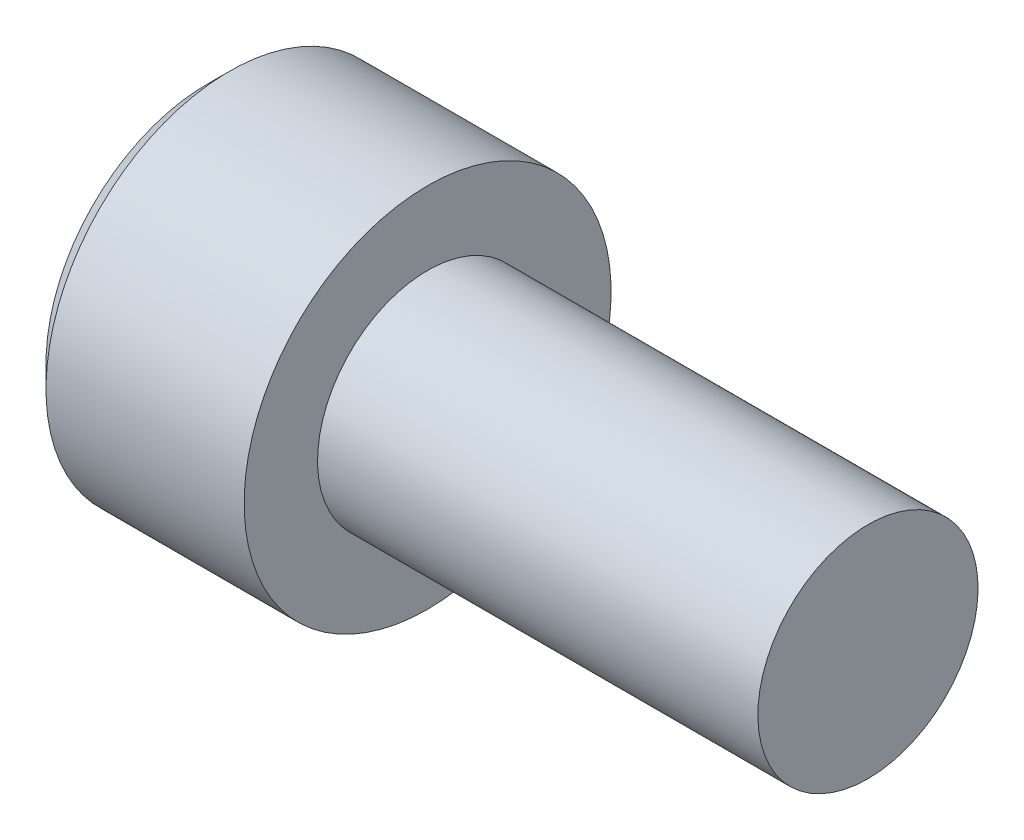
ISO-10303-21;
HEADER;
FILE_DESCRIPTION(('STEP AP214'),'2;1');
FILE_NAME('part.step','',(''),(''),'','','');
FILE_SCHEMA(('AUTOMOTIVE_DESIGN { 1 0 10303 214 1 1 1 1 }'));
ENDSEC;
DATA;
#1=APPLICATION_CONTEXT('core data for automotive mechanical design processes');
#2=APPLICATION_PROTOCOL_DEFINITION('international standard','automotive_design',2000,#1);
#3=PRODUCT_CONTEXT('',#1,'mechanical');
#4=PRODUCT('Part','Part','',(#3));
#5=PRODUCT_RELATED_PRODUCT_CATEGORY('part','',(#4));
#6=PRODUCT_DEFINITION_FORMATION('','',#4);
#7=PRODUCT_DEFINITION_CONTEXT('part definition',#1,'design');
#8=PRODUCT_DEFINITION('design','',#6,#7);
#9=PRODUCT_DEFINITION_SHAPE('','',#8);
#10=(LENGTH_UNIT() NAMED_UNIT(*) SI_UNIT(.MILLI.,.METRE.));
#11=(NAMED_UNIT(*) PLANE_ANGLE_UNIT() SI_UNIT($,.RADIAN.));
#12=(NAMED_UNIT(*) SI_UNIT($,.STERADIAN.) SOLID_ANGLE_UNIT());
#13=UNCERTAINTY_MEASURE_WITH_UNIT(LENGTH_MEASURE(1.E-05),#10,'distance_accuracy_value','');
#14=(GEOMETRIC_REPRESENTATION_CONTEXT(3) GLOBAL_UNCERTAINTY_ASSIGNED_CONTEXT((#13)) GLOBAL_UNIT_ASSIGNED_CONTEXT((#10,
#11,#12)) REPRESENTATION_CONTEXT('',''));
#15=CARTESIAN_POINT('',(0.,0.,0.));
#16=DIRECTION('',(0.,0.,1.));
#17=DIRECTION('',(1.,0.,0.));
#18=AXIS2_PLACEMENT_3D('',#15,#16,#17);
#19=CARTESIAN_POINT('',(-3.,0.,0.));
#20=DIRECTION('',(-1.,0.,0.));
#21=DIRECTION('',(0.,0.,1.));
#22=AXIS2_PLACEMENT_3D('',#19,#20,#21);
#23=PLANE('',#22);
#24=CARTESIAN_POINT('',(-2.9999999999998,0.,0.));
#25=DIRECTION('',(-1.,0.,0.));
#26=DIRECTION('',(0.,0.,1.));
#27=AXIS2_PLACEMENT_3D('',#24,#25,#26);
#28=CIRCLE('',#27,2.49999999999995);
#29=CARTESIAN_POINT('',(-2.9999999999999,2.16506350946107,1.24999999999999));
#30=VERTEX_POINT('',#29);
#31=CARTESIAN_POINT('',(-2.9999999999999,0.,2.49999999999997));
#32=VERTEX_POINT('',#31);
#33=EDGE_CURVE('E18',#30,#32,#28,.F.);
#34=ORIENTED_EDGE('',*,*,#33,.T.);
#35=DIRECTION('',(0.,1.,0.));
#36=VECTOR('',#35,1.);
#37=CARTESIAN_POINT('',(-3.,0.,2.5));
#38=LINE('',#37,#36);
#39=CARTESIAN_POINT('',(-3.,1.44337567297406,2.5));
#40=VERTEX_POINT('',#39);
#41=EDGE_CURVE('E83',#32,#40,#38,.T.);
#42=ORIENTED_EDGE('',*,*,#41,.T.);
#43=DIRECTION('',(0.,0.5,-0.866025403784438));
#44=VECTOR('',#43,1.);
#45=CARTESIAN_POINT('',(-3.,1.44337567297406,2.5));
#46=LINE('',#45,#44);
#47=EDGE_CURVE('E103',#40,#30,#46,.T.);
#48=ORIENTED_EDGE('',*,*,#47,.T.);
#49=EDGE_LOOP('',(#34,#42,#48));
#50=FACE_BOUND('',#49,.T.);
#51=ADVANCED_FACE('F15',(#50),#23,.T.);
#52=CARTESIAN_POINT('',(-3.,0.,0.));
#53=DIRECTION('',(-1.,0.,0.));
#54=DIRECTION('',(0.,0.,1.));
#55=AXIS2_PLACEMENT_3D('',#52,#53,#54);
#56=PLANE('',#55);
#57=CARTESIAN_POINT('',(-2.9999999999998,0.,0.));
#58=DIRECTION('',(-1.,0.,0.));
#59=DIRECTION('',(0.,0.,1.));
#60=AXIS2_PLACEMENT_3D('',#57,#58,#59);
#61=CIRCLE('',#60,2.49999999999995);
#62=CARTESIAN_POINT('',(-2.9999999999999,-2.16506350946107,1.24999999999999));
#63=VERTEX_POINT('',#62);
#64=EDGE_CURVE('E113',#32,#63,#61,.F.);
#65=ORIENTED_EDGE('',*,*,#64,.T.);
#66=DIRECTION('',(0.,0.5,0.866025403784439));
#67=VECTOR('',#66,1.);
#68=CARTESIAN_POINT('',(-3.,-2.1650635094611,1.25));
#69=LINE('',#68,#67);
#70=CARTESIAN_POINT('',(-3.,-1.44337567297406,2.5));
#71=VERTEX_POINT('',#70);
#72=EDGE_CURVE('E121',#63,#71,#69,.T.);
#73=ORIENTED_EDGE('',*,*,#72,.T.);
#74=DIRECTION('',(0.,1.,0.));
#75=VECTOR('',#74,1.);
#76=CARTESIAN_POINT('',(-3.,0.,2.5));
#77=LINE('',#76,#75);
#78=EDGE_CURVE('E129',#71,#32,#77,.T.);
#79=ORIENTED_EDGE('',*,*,#78,.T.);
#80=EDGE_LOOP('',(#65,#73,#79));
#81=FACE_BOUND('',#80,.T.);
#82=ADVANCED_FACE('F365',(#81),#56,.T.);
#83=CARTESIAN_POINT('',(-3.,0.,0.));
#84=DIRECTION('',(-1.,0.,0.));
#85=DIRECTION('',(0.,0.,1.));
#86=AXIS2_PLACEMENT_3D('',#83,#84,#85);
#87=PLANE('',#86);
#88=CARTESIAN_POINT('',(-2.9999999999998,0.,0.));
#89=DIRECTION('',(-1.,0.,0.));
#90=DIRECTION('',(0.,0.,1.));
#91=AXIS2_PLACEMENT_3D('',#88,#89,#90);
#92=CIRCLE('',#91,2.49999999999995);
#93=CARTESIAN_POINT('',(-2.9999999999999,0.,-2.49999999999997));
#94=VERTEX_POINT('',#93);
#95=CARTESIAN_POINT('',(-2.9999999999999,2.16506350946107,-1.24999999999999));
#96=VERTEX_POINT('',#95);
#97=EDGE_CURVE('E99',#94,#96,#92,.F.);
#98=ORIENTED_EDGE('',*,*,#97,.T.);
#99=DIRECTION('',(0.,-0.5,-0.866025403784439));
#100=VECTOR('',#99,1.);
#101=CARTESIAN_POINT('',(-3.,2.1650635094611,-1.25));
#102=LINE('',#101,#100);
#103=CARTESIAN_POINT('',(-3.,1.44337567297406,-2.5));
#104=VERTEX_POINT('',#103);
#105=EDGE_CURVE('E114',#96,#104,#102,.T.);
#106=ORIENTED_EDGE('',*,*,#105,.T.);
#107=DIRECTION('',(0.,1.,0.));
#108=VECTOR('',#107,1.);
#109=CARTESIAN_POINT('',(-3.,0.,-2.5));
#110=LINE('',#109,#108);
#111=EDGE_CURVE('E117',#104,#94,#110,.F.);
#112=ORIENTED_EDGE('',*,*,#111,.T.);
#113=EDGE_LOOP('',(#98,#106,#112));
#114=FACE_BOUND('',#113,.T.);
#115=ADVANCED_FACE('F356',(#114),#87,.T.);
#116=CARTESIAN_POINT('',(-2.99999999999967,0.,0.));
#117=DIRECTION('',(-1.,0.,0.));
#118=DIRECTION('',(0.,0.,1.));
#119=AXIS2_PLACEMENT_3D('',#116,#117,#118);
#120=CONICAL_SURFACE('',#119,2.49999999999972,1.04719755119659);
#121=CARTESIAN_POINT('',(-1.5566243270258,0.,0.));
#122=VERTEX_POINT('',#121);
#123=VERTEX_LOOP('',#122);
#124=FACE_BOUND('',#123,.T.);
#125=ORIENTED_EDGE('',*,*,#33,.F.);
#126=CARTESIAN_POINT('',(-2.9999999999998,0.,0.));
#127=DIRECTION('',(-1.,0.,0.));
#128=DIRECTION('',(0.,0.,1.));
#129=AXIS2_PLACEMENT_3D('',#126,#127,#128);
#130=CIRCLE('',#129,2.49999999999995);
#131=EDGE_CURVE('E89',#96,#30,#130,.F.);
#132=ORIENTED_EDGE('',*,*,#131,.F.);
#133=ORIENTED_EDGE('',*,*,#97,.F.);
#134=CARTESIAN_POINT('',(-2.9999999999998,0.,0.));
#135=DIRECTION('',(-1.,0.,0.));
#136=DIRECTION('',(0.,0.,1.));
#137=AXIS2_PLACEMENT_3D('',#134,#135,#136);
#138=CIRCLE('',#137,2.49999999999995);
#139=CARTESIAN_POINT('',(-2.9999999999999,-2.16506350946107,-1.24999999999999));
#140=VERTEX_POINT('',#139);
#141=EDGE_CURVE('E151',#140,#94,#138,.F.);
#142=ORIENTED_EDGE('',*,*,#141,.F.);
#143=CARTESIAN_POINT('',(-2.9999999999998,0.,0.));
#144=DIRECTION('',(-1.,0.,0.));
#145=DIRECTION('',(0.,0.,1.));
#146=AXIS2_PLACEMENT_3D('',#143,#144,#145);
#147=CIRCLE('',#146,2.49999999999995);
#148=EDGE_CURVE('E115',#63,#140,#147,.F.);
#149=ORIENTED_EDGE('',*,*,#148,.F.);
#150=ORIENTED_EDGE('',*,*,#64,.F.);
#151=EDGE_LOOP('',(#125,#132,#133,#142,#149,#150));
#152=FACE_BOUND('',#151,.T.);
#153=ADVANCED_FACE('F111',(#124,#152),#120,.F.);
#154=CARTESIAN_POINT('',(-3.,0.,0.));
#155=DIRECTION('',(-1.,0.,0.));
#156=DIRECTION('',(0.,0.,1.));
#157=AXIS2_PLACEMENT_3D('',#154,#155,#156);
#158=PLANE('',#157);
#159=ORIENTED_EDGE('',*,*,#141,.T.);
#160=DIRECTION('',(0.,1.,0.));
#161=VECTOR('',#160,1.);
#162=CARTESIAN_POINT('',(-3.,1.44337567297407,-2.5));
#163=LINE('',#162,#161);
#164=CARTESIAN_POINT('',(-3.,-1.44337567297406,-2.5));
#165=VERTEX_POINT('',#164);
#166=EDGE_CURVE('E153',#94,#165,#163,.F.);
#167=ORIENTED_EDGE('',*,*,#166,.T.);
#168=DIRECTION('',(0.,-0.500000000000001,0.866025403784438));
#169=VECTOR('',#168,1.);
#170=CARTESIAN_POINT('',(-3.,-1.44337567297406,-2.5));
#171=LINE('',#170,#169);
#172=EDGE_CURVE('E98',#165,#140,#171,.T.);
#173=ORIENTED_EDGE('',*,*,#172,.T.);
#174=EDGE_LOOP('',(#159,#167,#173));
#175=FACE_BOUND('',#174,.T.);
#176=ADVANCED_FACE('F175',(#175),#158,.T.);
#177=CARTESIAN_POINT('',(-3.,0.,0.));
#178=DIRECTION('',(-1.,0.,0.));
#179=DIRECTION('',(0.,0.,1.));
#180=AXIS2_PLACEMENT_3D('',#177,#178,#179);
#181=PLANE('',#180);
#182=ORIENTED_EDGE('',*,*,#148,.T.);
#183=DIRECTION('',(0.,0.5,-0.866025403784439));
#184=VECTOR('',#183,1.);
#185=CARTESIAN_POINT('',(-3.,-1.44337567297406,-2.5));
#186=LINE('',#185,#184);
#187=CARTESIAN_POINT('',(-3.,-2.88675134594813,0.));
#188=VERTEX_POINT('',#187);
#189=EDGE_CURVE('E160',#140,#188,#186,.F.);
#190=ORIENTED_EDGE('',*,*,#189,.T.);
#191=DIRECTION('',(0.,-0.5,-0.866025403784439));
#192=VECTOR('',#191,1.);
#193=CARTESIAN_POINT('',(-3.,-2.88675134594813,0.));
#194=LINE('',#193,#192);
#195=EDGE_CURVE('E139',#188,#63,#194,.F.);
#196=ORIENTED_EDGE('',*,*,#195,.T.);
#197=EDGE_LOOP('',(#182,#190,#196));
#198=FACE_BOUND('',#197,.T.);
#199=ADVANCED_FACE('F159',(#198),#181,.T.);
#200=CARTESIAN_POINT('',(-3.,0.,0.));
#201=DIRECTION('',(-1.,0.,0.));
#202=DIRECTION('',(0.,0.,1.));
#203=AXIS2_PLACEMENT_3D('',#200,#201,#202);
#204=PLANE('',#203);
#205=ORIENTED_EDGE('',*,*,#131,.T.);
#206=DIRECTION('',(0.,-0.5,0.866025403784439));
#207=VECTOR('',#206,1.);
#208=CARTESIAN_POINT('',(-3.,1.44337567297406,2.5));
#209=LINE('',#208,#207);
#210=CARTESIAN_POINT('',(-3.,2.88675134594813,0.));
#211=VERTEX_POINT('',#210);
#212=EDGE_CURVE('E92',#30,#211,#209,.F.);
#213=ORIENTED_EDGE('',*,*,#212,.T.);
#214=DIRECTION('',(0.,0.5,0.866025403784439));
#215=VECTOR('',#214,1.);
#216=CARTESIAN_POINT('',(-3.,2.88675134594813,0.));
#217=LINE('',#216,#215);
#218=EDGE_CURVE('E94',#211,#96,#217,.F.);
#219=ORIENTED_EDGE('',*,*,#218,.T.);
#220=EDGE_LOOP('',(#205,#213,#219));
#221=FACE_BOUND('',#220,.T.);
#222=ADVANCED_FACE('F91',(#221),#204,.T.);
#223=CARTESIAN_POINT('',(-3.,1.44337567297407,-2.5));
#224=DIRECTION('',(0.,0.,-1.));
#225=DIRECTION('',(-1.,0.,0.));
#226=AXIS2_PLACEMENT_3D('',#223,#224,#225);
#227=PLANE('',#226);
#228=DIRECTION('',(1.,0.,0.));
#229=VECTOR('',#228,1.);
#230=CARTESIAN_POINT('',(-3.,-1.44337567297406,-2.5));
#231=LINE('',#230,#229);
#232=CARTESIAN_POINT('',(-6.,-1.44337567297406,-2.5));
#233=VERTEX_POINT('',#232);
#234=EDGE_CURVE('E124',#233,#165,#231,.T.);
#235=ORIENTED_EDGE('',*,*,#234,.T.);
#236=ORIENTED_EDGE('',*,*,#166,.F.);
#237=ORIENTED_EDGE('',*,*,#111,.F.);
#238=DIRECTION('',(1.,0.,0.));
#239=VECTOR('',#238,1.);
#240=CARTESIAN_POINT('',(-3.,1.44337567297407,-2.5));
#241=LINE('',#240,#239);
#242=CARTESIAN_POINT('',(-6.,1.44337567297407,-2.5));
#243=VERTEX_POINT('',#242);
#244=EDGE_CURVE('E132',#104,#243,#241,.F.);
#245=ORIENTED_EDGE('',*,*,#244,.T.);
#246=DIRECTION('',(0.,1.,0.));
#247=VECTOR('',#246,1.);
#248=CARTESIAN_POINT('',(-6.,0.,-2.5));
#249=LINE('',#248,#247);
#250=EDGE_CURVE('E135',#243,#233,#249,.F.);
#251=ORIENTED_EDGE('',*,*,#250,.T.);
#252=EDGE_LOOP('',(#235,#236,#237,#245,#251));
#253=FACE_BOUND('',#252,.T.);
#254=ADVANCED_FACE('F183',(#253),#227,.F.);
#255=CARTESIAN_POINT('',(-3.,-1.44337567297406,-2.5));
#256=DIRECTION('',(0.,-0.866025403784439,-0.5));
#257=DIRECTION('',(0.,0.5,-0.866025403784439));
#258=AXIS2_PLACEMENT_3D('',#255,#256,#257);
#259=PLANE('',#258);
#260=DIRECTION('',(1.,0.,0.));
#261=VECTOR('',#260,1.);
#262=CARTESIAN_POINT('',(-3.,-2.88675134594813,0.));
#263=LINE('',#262,#261);
#264=CARTESIAN_POINT('',(-6.,-2.88675134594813,0.));
#265=VERTEX_POINT('',#264);
#266=EDGE_CURVE('E171',#265,#188,#263,.T.);
#267=ORIENTED_EDGE('',*,*,#266,.T.);
#268=ORIENTED_EDGE('',*,*,#189,.F.);
#269=ORIENTED_EDGE('',*,*,#172,.F.);
#270=ORIENTED_EDGE('',*,*,#234,.F.);
#271=DIRECTION('',(0.,-0.5,0.866025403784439));
#272=VECTOR('',#271,1.);
#273=CARTESIAN_POINT('',(-6.,-1.44337567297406,-2.5));
#274=LINE('',#273,#272);
#275=EDGE_CURVE('E186',#233,#265,#274,.T.);
#276=ORIENTED_EDGE('',*,*,#275,.T.);
#277=EDGE_LOOP('',(#267,#268,#269,#270,#276));
#278=FACE_BOUND('',#277,.T.);
#279=ADVANCED_FACE('F166',(#278),#259,.F.);
#280=CARTESIAN_POINT('',(-3.,-2.88675134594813,0.));
#281=DIRECTION('',(0.,-0.866025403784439,0.5));
#282=DIRECTION('',(0.,-0.5,-0.866025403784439));
#283=AXIS2_PLACEMENT_3D('',#280,#281,#282);
#284=PLANE('',#283);
#285=DIRECTION('',(1.,0.,0.));
#286=VECTOR('',#285,1.);
#287=CARTESIAN_POINT('',(-3.,-1.44337567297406,2.5));
#288=LINE('',#287,#286);
#289=CARTESIAN_POINT('',(-6.,-1.44337567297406,2.5));
#290=VERTEX_POINT('',#289);
#291=EDGE_CURVE('E136',#290,#71,#288,.T.);
#292=ORIENTED_EDGE('',*,*,#291,.T.);
#293=ORIENTED_EDGE('',*,*,#72,.F.);
#294=ORIENTED_EDGE('',*,*,#195,.F.);
#295=ORIENTED_EDGE('',*,*,#266,.F.);
#296=DIRECTION('',(0.,0.5,0.866025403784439));
#297=VECTOR('',#296,1.);
#298=CARTESIAN_POINT('',(-6.,-2.88675134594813,0.));
#299=LINE('',#298,#297);
#300=EDGE_CURVE('E179',#265,#290,#299,.T.);
#301=ORIENTED_EDGE('',*,*,#300,.T.);
#302=EDGE_LOOP('',(#292,#293,#294,#295,#301));
#303=FACE_BOUND('',#302,.T.);
#304=ADVANCED_FACE('F305',(#303),#284,.F.);
#305=CARTESIAN_POINT('',(-3.,-1.44337567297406,2.5));
#306=DIRECTION('',(0.,0.,1.));
#307=DIRECTION('',(1.,0.,0.));
#308=AXIS2_PLACEMENT_3D('',#305,#306,#307);
#309=PLANE('',#308);
#310=DIRECTION('',(1.,0.,0.));
#311=VECTOR('',#310,1.);
#312=CARTESIAN_POINT('',(-3.,1.44337567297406,2.5));
#313=LINE('',#312,#311);
#314=CARTESIAN_POINT('',(-6.,1.44337567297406,2.5));
#315=VERTEX_POINT('',#314);
#316=EDGE_CURVE('E105',#315,#40,#313,.T.);
#317=ORIENTED_EDGE('',*,*,#316,.T.);
#318=ORIENTED_EDGE('',*,*,#41,.F.);
#319=ORIENTED_EDGE('',*,*,#78,.F.);
#320=ORIENTED_EDGE('',*,*,#291,.F.);
#321=DIRECTION('',(0.,1.,0.));
#322=VECTOR('',#321,1.);
#323=CARTESIAN_POINT('',(-6.,0.,2.5));
#324=LINE('',#323,#322);
#325=EDGE_CURVE('E194',#290,#315,#324,.T.);
#326=ORIENTED_EDGE('',*,*,#325,.T.);
#327=EDGE_LOOP('',(#317,#318,#319,#320,#326));
#328=FACE_BOUND('',#327,.T.);
#329=ADVANCED_FACE('F297',(#328),#309,.F.);
#330=CARTESIAN_POINT('',(-3.,1.44337567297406,2.5));
#331=DIRECTION('',(0.,0.866025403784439,0.5));
#332=DIRECTION('',(0.,-0.5,0.866025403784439));
#333=AXIS2_PLACEMENT_3D('',#330,#331,#332);
#334=PLANE('',#333);
#335=DIRECTION('',(1.,0.,0.));
#336=VECTOR('',#335,1.);
#337=CARTESIAN_POINT('',(-3.,2.88675134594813,0.));
#338=LINE('',#337,#336);
#339=CARTESIAN_POINT('',(-6.,2.88675134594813,0.));
#340=VERTEX_POINT('',#339);
#341=EDGE_CURVE('E104',#340,#211,#338,.T.);
#342=ORIENTED_EDGE('',*,*,#341,.T.);
#343=ORIENTED_EDGE('',*,*,#212,.F.);
#344=ORIENTED_EDGE('',*,*,#47,.F.);
#345=ORIENTED_EDGE('',*,*,#316,.F.);
#346=DIRECTION('',(0.,0.5,-0.866025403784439));
#347=VECTOR('',#346,1.);
#348=CARTESIAN_POINT('',(-6.,1.44337567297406,2.5));
#349=LINE('',#348,#347);
#350=EDGE_CURVE('E33',#315,#340,#349,.T.);
#351=ORIENTED_EDGE('',*,*,#350,.T.);
#352=EDGE_LOOP('',(#342,#343,#344,#345,#351));
#353=FACE_BOUND('',#352,.T.);
#354=ADVANCED_FACE('F102',(#353),#334,.F.);
#355=CARTESIAN_POINT('',(-3.,2.88675134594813,0.));
#356=DIRECTION('',(0.,0.866025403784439,-0.5));
#357=DIRECTION('',(0.,0.5,0.866025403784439));
#358=AXIS2_PLACEMENT_3D('',#355,#356,#357);
#359=PLANE('',#358);
#360=ORIENTED_EDGE('',*,*,#244,.F.);
#361=ORIENTED_EDGE('',*,*,#105,.F.);
#362=ORIENTED_EDGE('',*,*,#218,.F.);
#363=ORIENTED_EDGE('',*,*,#341,.F.);
#364=DIRECTION('',(0.,-0.5,-0.866025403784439));
#365=VECTOR('',#364,1.);
#366=CARTESIAN_POINT('',(-6.,2.88675134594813,0.));
#367=LINE('',#366,#365);
#368=EDGE_CURVE('E150',#340,#243,#367,.T.);
#369=ORIENTED_EDGE('',*,*,#368,.T.);
#370=EDGE_LOOP('',(#360,#361,#362,#363,#369));
#371=FACE_BOUND('',#370,.T.);
#372=ADVANCED_FACE('F217',(#371),#359,.F.);
#373=CARTESIAN_POINT('',(-6.,0.,0.));
#374=DIRECTION('',(1.,0.,0.));
#375=DIRECTION('',(0.,1.,0.));
#376=AXIS2_PLACEMENT_3D('',#373,#374,#375);
#377=PLANE('',#376);
#378=ORIENTED_EDGE('',*,*,#350,.F.);
#379=ORIENTED_EDGE('',*,*,#325,.F.);
#380=ORIENTED_EDGE('',*,*,#300,.F.);
#381=ORIENTED_EDGE('',*,*,#275,.F.);
#382=ORIENTED_EDGE('',*,*,#250,.F.);
#383=ORIENTED_EDGE('',*,*,#368,.F.);
#384=EDGE_LOOP('',(#378,#379,#380,#381,#382,#383));
#385=FACE_BOUND('',#384,.T.);
#386=CARTESIAN_POINT('',(-5.99999999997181,0.,0.));
#387=DIRECTION('',(1.,0.,0.));
#388=DIRECTION('',(0.,0.,-1.));
#389=AXIS2_PLACEMENT_3D('',#386,#387,#388);
#390=CIRCLE('',#389,4.39999999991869);
#391=CARTESIAN_POINT('',(-5.99999999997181,0.,-4.39999999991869));
#392=VERTEX_POINT('',#391);
#393=EDGE_CURVE('E147',#392,#392,#390,.T.);
#394=ORIENTED_EDGE('',*,*,#393,.F.);
#395=EDGE_LOOP('',(#394));
#396=FACE_BOUND('',#395,.T.);
#397=ADVANCED_FACE('F189',(#385,#396),#377,.F.);
#398=CARTESIAN_POINT('',(-5.40000000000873,0.,0.));
#399=DIRECTION('',(1.,0.,0.));
#400=DIRECTION('',(0.,0.,-1.));
#401=AXIS2_PLACEMENT_3D('',#398,#399,#400);
#402=CONICAL_SURFACE('',#401,4.99999999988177,0.785398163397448);
#403=CARTESIAN_POINT('',(-5.4,0.,0.));
#404=DIRECTION('',(-1.,0.,0.));
#405=DIRECTION('',(0.,-1.,0.));
#406=AXIS2_PLACEMENT_3D('',#403,#404,#405);
#407=CIRCLE('',#406,5.);
#408=CARTESIAN_POINT('',(-5.4,-5.,0.));
#409=VERTEX_POINT('',#408);
#410=EDGE_CURVE('E146',#409,#409,#407,.F.);
#411=ORIENTED_EDGE('',*,*,#410,.F.);
#412=EDGE_LOOP('',(#411));
#413=FACE_BOUND('',#412,.T.);
#414=ORIENTED_EDGE('',*,*,#393,.T.);
#415=EDGE_LOOP('',(#414));
#416=FACE_BOUND('',#415,.T.);
#417=ADVANCED_FACE('F211',(#413,#416),#402,.T.);
#418=CARTESIAN_POINT('',(-6.,0.,0.));
#419=DIRECTION('',(-1.,0.,0.));
#420=DIRECTION('',(0.,-1.,0.));
#421=AXIS2_PLACEMENT_3D('',#418,#419,#420);
#422=CYLINDRICAL_SURFACE('',#421,5.);
#423=ORIENTED_EDGE('',*,*,#410,.T.);
#424=EDGE_LOOP('',(#423));
#425=FACE_BOUND('',#424,.T.);
#426=CARTESIAN_POINT('',(0.,0.,0.));
#427=DIRECTION('',(-1.,0.,0.));
#428=DIRECTION('',(0.,-1.,0.));
#429=AXIS2_PLACEMENT_3D('',#426,#427,#428);
#430=CIRCLE('',#429,5.);
#431=CARTESIAN_POINT('',(0.,-5.,0.));
#432=VERTEX_POINT('',#431);
#433=EDGE_CURVE('E143',#432,#432,#430,.T.);
#434=ORIENTED_EDGE('',*,*,#433,.T.);
#435=EDGE_LOOP('',(#434));
#436=FACE_BOUND('',#435,.T.);
#437=ADVANCED_FACE('F208',(#425,#436),#422,.T.);
#438=CARTESIAN_POINT('',(12.,3.,0.));
#439=DIRECTION('',(-1.,0.,0.));
#440=DIRECTION('',(0.,-1.,0.));
#441=AXIS2_PLACEMENT_3D('',#438,#439,#440);
#442=PLANE('',#441);
#443=CARTESIAN_POINT('',(12.,0.,0.));
#444=DIRECTION('',(-1.,0.,0.));
#445=DIRECTION('',(0.,-1.,0.));
#446=AXIS2_PLACEMENT_3D('',#443,#444,#445);
#447=CIRCLE('',#446,3.);
#448=CARTESIAN_POINT('',(12.,-3.,0.));
#449=VERTEX_POINT('',#448);
#450=EDGE_CURVE('E24',#449,#449,#447,.T.);
#451=ORIENTED_EDGE('',*,*,#450,.F.);
#452=EDGE_LOOP('',(#451));
#453=FACE_BOUND('',#452,.T.);
#454=ADVANCED_FACE('F233',(#453),#442,.F.);
#455=CARTESIAN_POINT('',(0.,3.,0.));
#456=DIRECTION('',(-1.,0.,0.));
#457=DIRECTION('',(0.,-1.,0.));
#458=AXIS2_PLACEMENT_3D('',#455,#456,#457);
#459=PLANE('',#458);
#460=CARTESIAN_POINT('',(0.,0.,0.));
#461=DIRECTION('',(-1.,0.,0.));
#462=DIRECTION('',(0.,-1.,0.));
#463=AXIS2_PLACEMENT_3D('',#460,#461,#462);
#464=CIRCLE('',#463,3.);
#465=CARTESIAN_POINT('',(0.,-3.,0.));
#466=VERTEX_POINT('',#465);
#467=EDGE_CURVE('E10',#466,#466,#464,.F.);
#468=ORIENTED_EDGE('',*,*,#467,.F.);
#469=EDGE_LOOP('',(#468));
#470=FACE_BOUND('',#469,.T.);
#471=ORIENTED_EDGE('',*,*,#433,.F.);
#472=EDGE_LOOP('',(#471));
#473=FACE_BOUND('',#472,.T.);
#474=ADVANCED_FACE('F227',(#470,#473),#459,.F.);
#475=CARTESIAN_POINT('',(-6.,0.,0.));
#476=DIRECTION('',(-1.,0.,0.));
#477=DIRECTION('',(0.,-1.,0.));
#478=AXIS2_PLACEMENT_3D('',#475,#476,#477);
#479=CYLINDRICAL_SURFACE('',#478,3.);
#480=ORIENTED_EDGE('',*,*,#467,.T.);
#481=EDGE_LOOP('',(#480));
#482=FACE_BOUND('',#481,.T.);
#483=ORIENTED_EDGE('',*,*,#450,.T.);
#484=EDGE_LOOP('',(#483));
#485=FACE_BOUND('',#484,.T.);
#486=ADVANCED_FACE('F225',(#482,#485),#479,.T.);
#487=CLOSED_SHELL('',(#51,#82,#115,#153,#176,#199,#222,#254,#279,#304,#329,#354,#372,#397,#417,
#437,#454,#474,#486));
#488=MANIFOLD_SOLID_BREP('B1',#487);
#489=ADVANCED_BREP_SHAPE_REPRESENTATION('',(#18,#488),#14);
#490=SHAPE_DEFINITION_REPRESENTATION(#9,#489);
ENDSEC;
END-ISO-10303-21;
